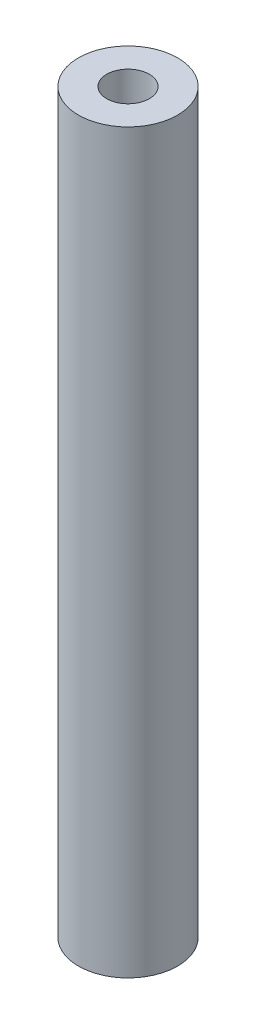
ISO-10303-21;
HEADER;
FILE_DESCRIPTION(('STEP AP214'),'2;1');
FILE_NAME('part.step','',(''),(''),'','','');
FILE_SCHEMA(('AUTOMOTIVE_DESIGN { 1 0 10303 214 1 1 1 1 }'));
ENDSEC;
DATA;
#1=APPLICATION_CONTEXT('core data for automotive mechanical design processes');
#2=APPLICATION_PROTOCOL_DEFINITION('international standard','automotive_design',2000,#1);
#3=PRODUCT_CONTEXT('',#1,'mechanical');
#4=PRODUCT('Part','Part','',(#3));
#5=PRODUCT_RELATED_PRODUCT_CATEGORY('part','',(#4));
#6=PRODUCT_DEFINITION_FORMATION('','',#4);
#7=PRODUCT_DEFINITION_CONTEXT('part definition',#1,'design');
#8=PRODUCT_DEFINITION('design','',#6,#7);
#9=PRODUCT_DEFINITION_SHAPE('','',#8);
#10=(LENGTH_UNIT() NAMED_UNIT(*) SI_UNIT(.MILLI.,.METRE.));
#11=(NAMED_UNIT(*) PLANE_ANGLE_UNIT() SI_UNIT($,.RADIAN.));
#12=(NAMED_UNIT(*) SI_UNIT($,.STERADIAN.) SOLID_ANGLE_UNIT());
#13=UNCERTAINTY_MEASURE_WITH_UNIT(LENGTH_MEASURE(1.E-05),#10,'distance_accuracy_value','');
#14=(GEOMETRIC_REPRESENTATION_CONTEXT(3) GLOBAL_UNCERTAINTY_ASSIGNED_CONTEXT((#13)) GLOBAL_UNIT_ASSIGNED_CONTEXT((#10,
#11,#12)) REPRESENTATION_CONTEXT('',''));
#15=CARTESIAN_POINT('',(0.,0.,0.));
#16=DIRECTION('',(0.,0.,1.));
#17=DIRECTION('',(1.,0.,0.));
#18=AXIS2_PLACEMENT_3D('',#15,#16,#17);
#19=CARTESIAN_POINT('',(0.,52.,0.));
#20=DIRECTION('',(0.,1.,0.));
#21=DIRECTION('',(0.,0.,1.));
#22=AXIS2_PLACEMENT_3D('',#19,#20,#21);
#23=PLANE('',#22);
#24=CARTESIAN_POINT('',(0.,52.,0.));
#25=DIRECTION('',(0.,1.,0.));
#26=DIRECTION('',(0.,0.,1.));
#27=AXIS2_PLACEMENT_3D('',#24,#25,#26);
#28=CIRCLE('',#27,3.5);
#29=CARTESIAN_POINT('',(0.,52.,-3.5));
#30=VERTEX_POINT('',#29);
#31=EDGE_CURVE('E10',#30,#30,#28,.T.);
#32=ORIENTED_EDGE('',*,*,#31,.T.);
#33=EDGE_LOOP('',(#32));
#34=FACE_BOUND('',#33,.T.);
#35=CARTESIAN_POINT('',(0.,52.,0.));
#36=DIRECTION('',(0.,1.,0.));
#37=DIRECTION('',(0.,0.,1.));
#38=AXIS2_PLACEMENT_3D('',#35,#36,#37);
#39=CIRCLE('',#38,1.5);
#40=CARTESIAN_POINT('',(0.,52.,-1.5));
#41=VERTEX_POINT('',#40);
#42=EDGE_CURVE('E42',#41,#41,#39,.T.);
#43=ORIENTED_EDGE('',*,*,#42,.F.);
#44=EDGE_LOOP('',(#43));
#45=FACE_BOUND('',#44,.T.);
#46=ADVANCED_FACE('F31',(#34,#45),#23,.T.);
#47=CARTESIAN_POINT('',(0.,0.,0.));
#48=DIRECTION('',(0.,1.,0.));
#49=DIRECTION('',(0.,0.,1.));
#50=AXIS2_PLACEMENT_3D('',#47,#48,#49);
#51=PLANE('',#50);
#52=CARTESIAN_POINT('',(0.,0.,0.));
#53=DIRECTION('',(0.,1.,0.));
#54=DIRECTION('',(0.,0.,1.));
#55=AXIS2_PLACEMENT_3D('',#52,#53,#54);
#56=CIRCLE('',#55,3.5);
#57=CARTESIAN_POINT('',(0.,0.,-3.5));
#58=VERTEX_POINT('',#57);
#59=EDGE_CURVE('E35',#58,#58,#56,.T.);
#60=ORIENTED_EDGE('',*,*,#59,.F.);
#61=EDGE_LOOP('',(#60));
#62=FACE_BOUND('',#61,.T.);
#63=CARTESIAN_POINT('',(0.,0.,0.));
#64=DIRECTION('',(0.,1.,0.));
#65=DIRECTION('',(0.,0.,1.));
#66=AXIS2_PLACEMENT_3D('',#63,#64,#65);
#67=CIRCLE('',#66,1.5);
#68=CARTESIAN_POINT('',(0.,0.,-1.5));
#69=VERTEX_POINT('',#68);
#70=EDGE_CURVE('E44',#69,#69,#67,.T.);
#71=ORIENTED_EDGE('',*,*,#70,.T.);
#72=EDGE_LOOP('',(#71));
#73=FACE_BOUND('',#72,.T.);
#74=ADVANCED_FACE('F54',(#62,#73),#51,.F.);
#75=CARTESIAN_POINT('',(0.,52.,0.));
#76=DIRECTION('',(0.,-1.,0.));
#77=DIRECTION('',(0.,0.,-1.));
#78=AXIS2_PLACEMENT_3D('',#75,#76,#77);
#79=CYLINDRICAL_SURFACE('',#78,3.5);
#80=CARTESIAN_POINT('',(0.,52.,-3.5));
#81=CARTESIAN_POINT('',(0.,51.4583333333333,-3.5));
#82=CARTESIAN_POINT('',(0.,50.9166666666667,-3.5));
#83=CARTESIAN_POINT('',(0.,49.8333333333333,-3.5));
#84=CARTESIAN_POINT('',(0.,49.2916666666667,-3.5));
#85=CARTESIAN_POINT('',(0.,48.2083333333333,-3.5));
#86=CARTESIAN_POINT('',(0.,47.6666666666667,-3.5));
#87=CARTESIAN_POINT('',(0.,46.5833333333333,-3.5));
#88=CARTESIAN_POINT('',(0.,46.0416666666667,-3.5));
#89=CARTESIAN_POINT('',(0.,44.9583333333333,-3.5));
#90=CARTESIAN_POINT('',(0.,44.4166666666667,-3.5));
#91=CARTESIAN_POINT('',(0.,43.3333333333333,-3.5));
#92=CARTESIAN_POINT('',(0.,42.7916666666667,-3.5));
#93=CARTESIAN_POINT('',(0.,41.7083333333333,-3.5));
#94=CARTESIAN_POINT('',(0.,41.1666666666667,-3.5));
#95=CARTESIAN_POINT('',(0.,40.0833333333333,-3.5));
#96=CARTESIAN_POINT('',(0.,39.5416666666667,-3.5));
#97=CARTESIAN_POINT('',(0.,38.4583333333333,-3.5));
#98=CARTESIAN_POINT('',(0.,37.9166666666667,-3.5));
#99=CARTESIAN_POINT('',(0.,36.8333333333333,-3.5));
#100=CARTESIAN_POINT('',(0.,36.2916666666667,-3.5));
#101=CARTESIAN_POINT('',(0.,35.2083333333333,-3.5));
#102=CARTESIAN_POINT('',(0.,34.6666666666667,-3.5));
#103=CARTESIAN_POINT('',(0.,33.5833333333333,-3.5));
#104=CARTESIAN_POINT('',(0.,33.0416666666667,-3.5));
#105=CARTESIAN_POINT('',(0.,31.9583333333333,-3.5));
#106=CARTESIAN_POINT('',(0.,31.4166666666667,-3.5));
#107=CARTESIAN_POINT('',(0.,30.3333333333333,-3.5));
#108=CARTESIAN_POINT('',(0.,29.7916666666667,-3.5));
#109=CARTESIAN_POINT('',(0.,28.7083333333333,-3.5));
#110=CARTESIAN_POINT('',(0.,28.1666666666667,-3.5));
#111=CARTESIAN_POINT('',(0.,27.0833333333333,-3.5));
#112=CARTESIAN_POINT('',(0.,26.5416666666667,-3.5));
#113=CARTESIAN_POINT('',(0.,25.4583333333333,-3.5));
#114=CARTESIAN_POINT('',(0.,24.9166666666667,-3.5));
#115=CARTESIAN_POINT('',(0.,23.8333333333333,-3.5));
#116=CARTESIAN_POINT('',(0.,23.2916666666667,-3.5));
#117=CARTESIAN_POINT('',(0.,22.2083333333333,-3.5));
#118=CARTESIAN_POINT('',(0.,21.6666666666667,-3.5));
#119=CARTESIAN_POINT('',(0.,20.5833333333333,-3.5));
#120=CARTESIAN_POINT('',(0.,20.0416666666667,-3.5));
#121=CARTESIAN_POINT('',(0.,18.9583333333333,-3.5));
#122=CARTESIAN_POINT('',(0.,18.4166666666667,-3.5));
#123=CARTESIAN_POINT('',(0.,17.3333333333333,-3.5));
#124=CARTESIAN_POINT('',(0.,16.7916666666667,-3.5));
#125=CARTESIAN_POINT('',(0.,15.7083333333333,-3.5));
#126=CARTESIAN_POINT('',(0.,15.1666666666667,-3.5));
#127=CARTESIAN_POINT('',(0.,14.0833333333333,-3.5));
#128=CARTESIAN_POINT('',(0.,13.5416666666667,-3.5));
#129=CARTESIAN_POINT('',(0.,12.4583333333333,-3.5));
#130=CARTESIAN_POINT('',(0.,11.9166666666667,-3.5));
#131=CARTESIAN_POINT('',(0.,10.8333333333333,-3.5));
#132=CARTESIAN_POINT('',(0.,10.2916666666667,-3.5));
#133=CARTESIAN_POINT('',(0.,9.20833333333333,-3.5));
#134=CARTESIAN_POINT('',(0.,8.66666666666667,-3.5));
#135=CARTESIAN_POINT('',(0.,7.58333333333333,-3.5));
#136=CARTESIAN_POINT('',(0.,7.04166666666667,-3.5));
#137=CARTESIAN_POINT('',(0.,5.95833333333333,-3.5));
#138=CARTESIAN_POINT('',(0.,5.41666666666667,-3.5));
#139=CARTESIAN_POINT('',(0.,4.33333333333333,-3.5));
#140=CARTESIAN_POINT('',(0.,3.79166666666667,-3.5));
#141=CARTESIAN_POINT('',(0.,2.70833333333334,-3.5));
#142=CARTESIAN_POINT('',(0.,2.16666666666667,-3.5));
#143=CARTESIAN_POINT('',(0.,1.08333333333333,-3.5));
#144=CARTESIAN_POINT('',(0.,0.541666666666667,-3.5));
#145=CARTESIAN_POINT('',(0.,0.,-3.5));
#146=B_SPLINE_CURVE_WITH_KNOTS('',3,(#80,#81,#82,#83,#84,#85,#86,#87,#88,#89,#90,#91,#92,#93,
#94,#95,#96,#97,#98,#99,#100,#101,#102,#103,#104,#105,#106,#107,#108,#109,#110,#111,#112,#113,
#114,#115,#116,#117,#118,#119,#120,#121,#122,#123,#124,#125,#126,#127,#128,#129,#130,#131,#132,
#133,#134,#135,#136,#137,#138,#139,#140,#141,#142,#143,#144,#145),.UNSPECIFIED.,.F.,.F.,(4,2,2,
2,2,2,2,2,2,2,2,2,2,2,2,2,2,2,2,2,2,2,2,2,2,2,2,2,2,2,2,2,4),(0.,1.62499999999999,3.25,4.875,
6.49999999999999,8.12499999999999,9.74999999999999,11.375,13.,14.625,16.25,17.875,19.5,21.125,
22.75,24.375,26.,27.625,29.25,30.875,32.5,34.125,35.75,37.375,39.,40.625,42.25,43.875,45.5,
47.125,48.75,50.375,52.),.UNSPECIFIED.);
#147=EDGE_CURVE('BSEAM33',#30,#58,#146,.T.);
#148=ORIENTED_EDGE('',*,*,#31,.F.);
#149=ORIENTED_EDGE('',*,*,#59,.T.);
#150=ORIENTED_EDGE('',*,*,#147,.T.);
#151=ORIENTED_EDGE('',*,*,#147,.F.);
#152=EDGE_LOOP('',(#148,#150,#149,#151));
#153=FACE_BOUND('',#152,.T.);
#154=ADVANCED_FACE('F33',(#153),#79,.T.);
#155=CARTESIAN_POINT('',(0.,52.,0.));
#156=DIRECTION('',(0.,-1.,0.));
#157=DIRECTION('',(0.,0.,-1.));
#158=AXIS2_PLACEMENT_3D('',#155,#156,#157);
#159=CYLINDRICAL_SURFACE('',#158,1.5);
#160=CARTESIAN_POINT('',(0.,52.,-1.5));
#161=CARTESIAN_POINT('',(0.,51.4583333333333,-1.5));
#162=CARTESIAN_POINT('',(0.,50.9166666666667,-1.5));
#163=CARTESIAN_POINT('',(0.,49.8333333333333,-1.5));
#164=CARTESIAN_POINT('',(0.,49.2916666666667,-1.5));
#165=CARTESIAN_POINT('',(0.,48.2083333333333,-1.5));
#166=CARTESIAN_POINT('',(0.,47.6666666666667,-1.5));
#167=CARTESIAN_POINT('',(0.,46.5833333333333,-1.5));
#168=CARTESIAN_POINT('',(0.,46.0416666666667,-1.5));
#169=CARTESIAN_POINT('',(0.,44.9583333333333,-1.5));
#170=CARTESIAN_POINT('',(0.,44.4166666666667,-1.5));
#171=CARTESIAN_POINT('',(0.,43.3333333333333,-1.5));
#172=CARTESIAN_POINT('',(0.,42.7916666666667,-1.5));
#173=CARTESIAN_POINT('',(0.,41.7083333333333,-1.5));
#174=CARTESIAN_POINT('',(0.,41.1666666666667,-1.5));
#175=CARTESIAN_POINT('',(0.,40.0833333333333,-1.5));
#176=CARTESIAN_POINT('',(0.,39.5416666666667,-1.5));
#177=CARTESIAN_POINT('',(0.,38.4583333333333,-1.5));
#178=CARTESIAN_POINT('',(0.,37.9166666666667,-1.5));
#179=CARTESIAN_POINT('',(0.,36.8333333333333,-1.5));
#180=CARTESIAN_POINT('',(0.,36.2916666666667,-1.5));
#181=CARTESIAN_POINT('',(0.,35.2083333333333,-1.5));
#182=CARTESIAN_POINT('',(0.,34.6666666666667,-1.5));
#183=CARTESIAN_POINT('',(0.,33.5833333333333,-1.5));
#184=CARTESIAN_POINT('',(0.,33.0416666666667,-1.5));
#185=CARTESIAN_POINT('',(0.,31.9583333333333,-1.5));
#186=CARTESIAN_POINT('',(0.,31.4166666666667,-1.5));
#187=CARTESIAN_POINT('',(0.,30.3333333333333,-1.5));
#188=CARTESIAN_POINT('',(0.,29.7916666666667,-1.5));
#189=CARTESIAN_POINT('',(0.,28.7083333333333,-1.5));
#190=CARTESIAN_POINT('',(0.,28.1666666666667,-1.5));
#191=CARTESIAN_POINT('',(0.,27.0833333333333,-1.5));
#192=CARTESIAN_POINT('',(0.,26.5416666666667,-1.5));
#193=CARTESIAN_POINT('',(0.,25.4583333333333,-1.5));
#194=CARTESIAN_POINT('',(0.,24.9166666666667,-1.5));
#195=CARTESIAN_POINT('',(0.,23.8333333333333,-1.5));
#196=CARTESIAN_POINT('',(0.,23.2916666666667,-1.5));
#197=CARTESIAN_POINT('',(0.,22.2083333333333,-1.5));
#198=CARTESIAN_POINT('',(0.,21.6666666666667,-1.5));
#199=CARTESIAN_POINT('',(0.,20.5833333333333,-1.5));
#200=CARTESIAN_POINT('',(0.,20.0416666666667,-1.5));
#201=CARTESIAN_POINT('',(0.,18.9583333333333,-1.5));
#202=CARTESIAN_POINT('',(0.,18.4166666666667,-1.5));
#203=CARTESIAN_POINT('',(0.,17.3333333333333,-1.5));
#204=CARTESIAN_POINT('',(0.,16.7916666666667,-1.5));
#205=CARTESIAN_POINT('',(0.,15.7083333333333,-1.5));
#206=CARTESIAN_POINT('',(0.,15.1666666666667,-1.5));
#207=CARTESIAN_POINT('',(0.,14.0833333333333,-1.5));
#208=CARTESIAN_POINT('',(0.,13.5416666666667,-1.5));
#209=CARTESIAN_POINT('',(0.,12.4583333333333,-1.5));
#210=CARTESIAN_POINT('',(0.,11.9166666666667,-1.5));
#211=CARTESIAN_POINT('',(0.,10.8333333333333,-1.5));
#212=CARTESIAN_POINT('',(0.,10.2916666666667,-1.5));
#213=CARTESIAN_POINT('',(0.,9.20833333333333,-1.5));
#214=CARTESIAN_POINT('',(0.,8.66666666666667,-1.5));
#215=CARTESIAN_POINT('',(0.,7.58333333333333,-1.5));
#216=CARTESIAN_POINT('',(0.,7.04166666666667,-1.5));
#217=CARTESIAN_POINT('',(0.,5.95833333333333,-1.5));
#218=CARTESIAN_POINT('',(0.,5.41666666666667,-1.5));
#219=CARTESIAN_POINT('',(0.,4.33333333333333,-1.5));
#220=CARTESIAN_POINT('',(0.,3.79166666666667,-1.5));
#221=CARTESIAN_POINT('',(0.,2.70833333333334,-1.5));
#222=CARTESIAN_POINT('',(0.,2.16666666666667,-1.5));
#223=CARTESIAN_POINT('',(0.,1.08333333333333,-1.5));
#224=CARTESIAN_POINT('',(0.,0.541666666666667,-1.5));
#225=CARTESIAN_POINT('',(0.,0.,-1.5));
#226=B_SPLINE_CURVE_WITH_KNOTS('',3,(#160,#161,#162,#163,#164,#165,#166,#167,#168,#169,#170,
#171,#172,#173,#174,#175,#176,#177,#178,#179,#180,#181,#182,#183,#184,#185,#186,#187,#188,#189,
#190,#191,#192,#193,#194,#195,#196,#197,#198,#199,#200,#201,#202,#203,#204,#205,#206,#207,#208,
#209,#210,#211,#212,#213,#214,#215,#216,#217,#218,#219,#220,#221,#222,#223,#224,#225),
.UNSPECIFIED.,.F.,.F.,(4,2,2,2,2,2,2,2,2,2,2,2,2,2,2,2,2,2,2,2,2,2,2,2,2,2,2,2,2,2,2,2,4),(0.,
1.62499999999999,3.25,4.875,6.49999999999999,8.12499999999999,9.74999999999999,11.375,13.,
14.625,16.25,17.875,19.5,21.125,22.75,24.375,26.,27.625,29.25,30.875,32.5,34.125,35.75,37.375,
39.,40.625,42.25,43.875,45.5,47.125,48.75,50.375,52.),.UNSPECIFIED.);
#227=EDGE_CURVE('BSEAM50',#41,#69,#226,.T.);
#228=ORIENTED_EDGE('',*,*,#42,.T.);
#229=ORIENTED_EDGE('',*,*,#70,.F.);
#230=ORIENTED_EDGE('',*,*,#227,.T.);
#231=ORIENTED_EDGE('',*,*,#227,.F.);
#232=EDGE_LOOP('',(#228,#230,#229,#231));
#233=FACE_BOUND('',#232,.T.);
#234=ADVANCED_FACE('F50',(#233),#159,.F.);
#235=CLOSED_SHELL('',(#46,#74,#154,#234));
#236=MANIFOLD_SOLID_BREP('B2',#235);
#237=ADVANCED_BREP_SHAPE_REPRESENTATION('',(#18,#236),#14);
#238=SHAPE_DEFINITION_REPRESENTATION(#9,#237);
ENDSEC;
END-ISO-10303-21;
